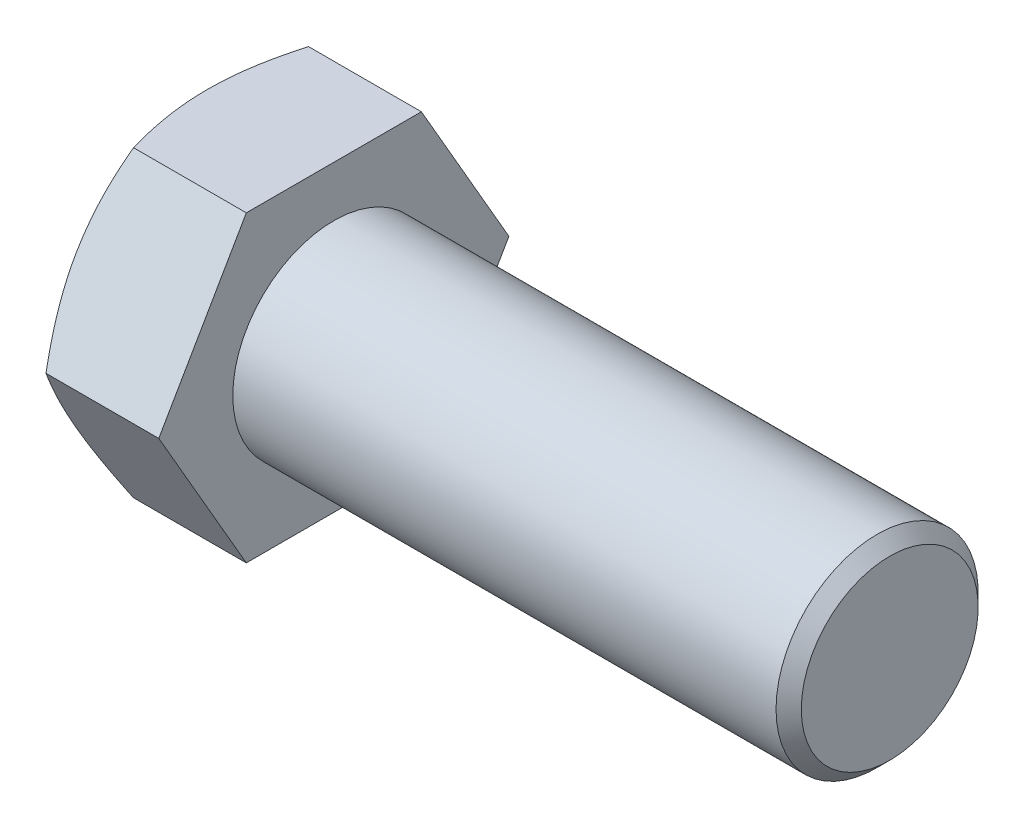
from build123d import *

# Parameters (mm, degrees)
CHANFREIN1_SIZE    = 1
SKETCH_H_OUTSIDE_W = 43.058
SKETCH_H_OUTSIDE_H = 43.058
HEXAGONE_DEPTH     = 58.445822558


with BuildPart() as part:
    # Contour → Base-R_volution (revolve)
    with BuildSketch(Plane.XY, mode=Mode.PRIVATE) as base_r_volution_sk:
        Polygon((0, 8), (44, 8), (44, 0), (-10, 0), (-10, 12), (-8.927968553, 13.856812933), (0, 13.856812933), align=None)
    revolve(base_r_volution_sk.sketch.rotate(Axis((-30, 0, 0), (1, 0, 0)), 90), axis=Axis((-30, 0, 0), (1, 0, 0)))

    # Chanfrein1
    chanfrein1_edges = [part.edges().sort_by_distance(p)[0] for p in [
        (44, 0, -8),
    ]]
    chamfer(chanfrein1_edges, length=CHANFREIN1_SIZE)

    # Sketch H outside → Hexagone (cut, through all)
    with BuildSketch(Plane.ZY.offset(10)):
        Rectangle(SKETCH_H_OUTSIDE_W, SKETCH_H_OUTSIDE_H)
        Polygon((13.856406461, 0), (6.92820323, 12), (-6.92820323, 12), (-13.856406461, 0), (-6.92820323, -12), (6.92820323, -12), align=None, mode=Mode.SUBTRACT)
    extrude(amount=-HEXAGONE_DEPTH, mode=Mode.SUBTRACT)


solid = part.part
